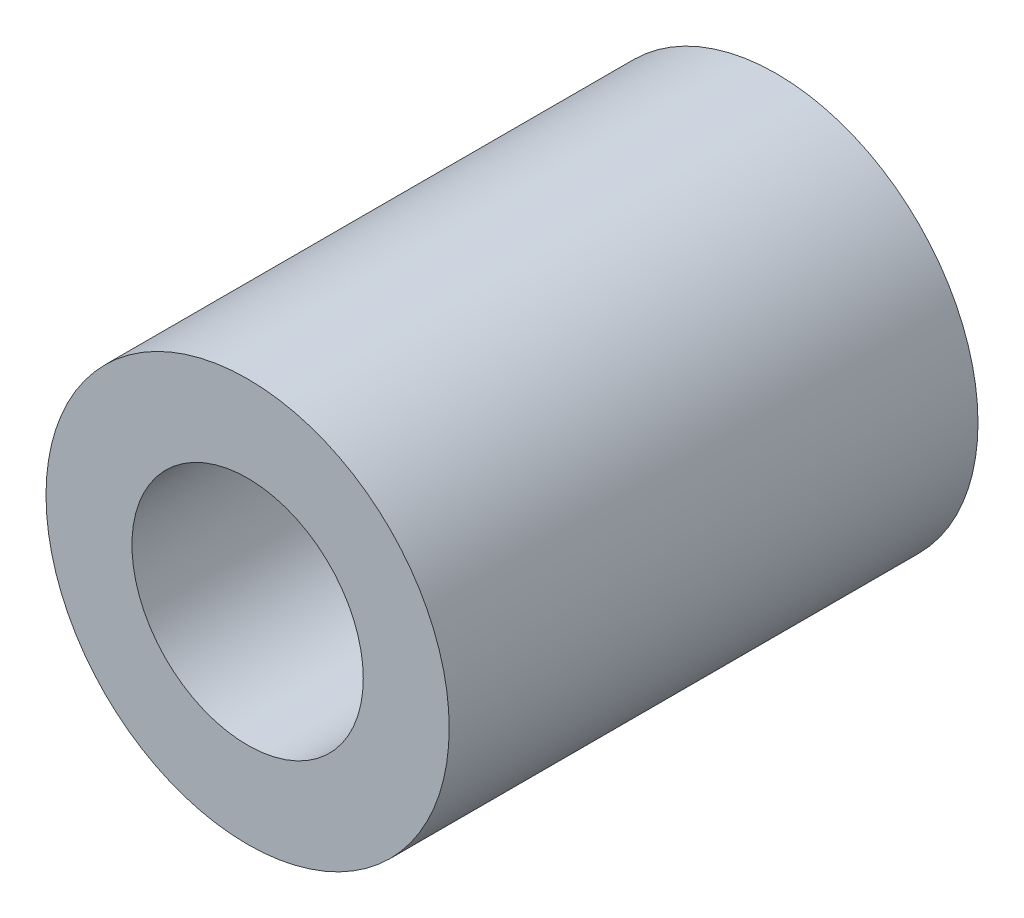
from build123d import *

# Parameters (mm, degrees)
SKETCH1_R           = 3.05
SKETCH1_R_2         = 1.75
BOSS_EXTRUDE1_DEPTH = 8


with BuildPart() as part:
    # Sketch1 → Boss-Extrude1 (new body)
    with BuildSketch(Plane.XY):
        Circle(SKETCH1_R)
        Circle(SKETCH1_R_2, mode=Mode.SUBTRACT)
    extrude(amount=BOSS_EXTRUDE1_DEPTH)


solid = part.part
